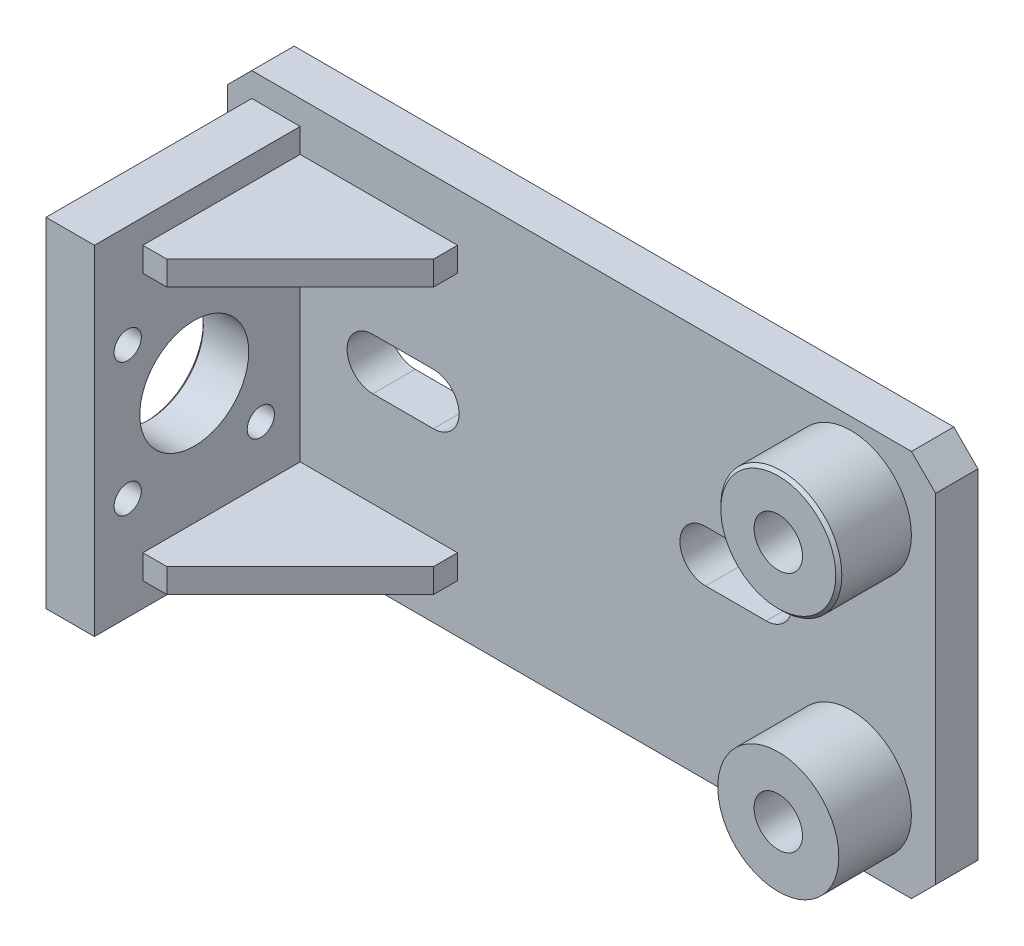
ISO-10303-21;
HEADER;
FILE_DESCRIPTION(('STEP AP214'),'2;1');
FILE_NAME('part.step','',(''),(''),'','','');
FILE_SCHEMA(('AUTOMOTIVE_DESIGN { 1 0 10303 214 1 1 1 1 }'));
ENDSEC;
DATA;
#1=APPLICATION_CONTEXT('core data for automotive mechanical design processes');
#2=APPLICATION_PROTOCOL_DEFINITION('international standard','automotive_design',2000,#1);
#3=PRODUCT_CONTEXT('',#1,'mechanical');
#4=PRODUCT('Part','Part','',(#3));
#5=PRODUCT_RELATED_PRODUCT_CATEGORY('part','',(#4));
#6=PRODUCT_DEFINITION_FORMATION('','',#4);
#7=PRODUCT_DEFINITION_CONTEXT('part definition',#1,'design');
#8=PRODUCT_DEFINITION('design','',#6,#7);
#9=PRODUCT_DEFINITION_SHAPE('','',#8);
#10=(LENGTH_UNIT() NAMED_UNIT(*) SI_UNIT(.MILLI.,.METRE.));
#11=(NAMED_UNIT(*) PLANE_ANGLE_UNIT() SI_UNIT($,.RADIAN.));
#12=(NAMED_UNIT(*) SI_UNIT($,.STERADIAN.) SOLID_ANGLE_UNIT());
#13=UNCERTAINTY_MEASURE_WITH_UNIT(LENGTH_MEASURE(1.E-05),#10,'distance_accuracy_value','');
#14=(GEOMETRIC_REPRESENTATION_CONTEXT(3) GLOBAL_UNCERTAINTY_ASSIGNED_CONTEXT((#13)) GLOBAL_UNIT_ASSIGNED_CONTEXT((#10,
#11,#12)) REPRESENTATION_CONTEXT('',''));
#15=CARTESIAN_POINT('',(0.,0.,0.));
#16=DIRECTION('',(0.,0.,1.));
#17=DIRECTION('',(1.,0.,0.));
#18=AXIS2_PLACEMENT_3D('',#15,#16,#17);
#19=CARTESIAN_POINT('',(-89.,32.,7.));
#20=DIRECTION('',(0.,0.,1.));
#21=DIRECTION('',(1.,0.,0.));
#22=AXIS2_PLACEMENT_3D('',#19,#20,#21);
#23=PLANE('',#22);
#24=CARTESIAN_POINT('',(-10.,0.,7.));
#25=DIRECTION('',(0.,0.,1.));
#26=DIRECTION('',(1.,0.,0.));
#27=AXIS2_PLACEMENT_3D('',#24,#25,#26);
#28=CIRCLE('',#27,4.25);
#29=CARTESIAN_POINT('',(-10.,4.25,7.));
#30=VERTEX_POINT('',#29);
#31=CARTESIAN_POINT('',(-9.99999999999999,-4.25,7.));
#32=VERTEX_POINT('',#31);
#33=EDGE_CURVE('E51',#30,#32,#28,.T.);
#34=ORIENTED_EDGE('',*,*,#33,.F.);
#35=DIRECTION('',(-1.,0.,0.));
#36=VECTOR('',#35,1.);
#37=CARTESIAN_POINT('',(-10.,4.25,7.));
#38=LINE('',#37,#36);
#39=CARTESIAN_POINT('',(0.,4.25,7.));
#40=VERTEX_POINT('',#39);
#41=EDGE_CURVE('E251',#40,#30,#38,.T.);
#42=ORIENTED_EDGE('',*,*,#41,.F.);
#43=CARTESIAN_POINT('',(0.,0.,7.));
#44=DIRECTION('',(0.,0.,1.));
#45=DIRECTION('',(1.,0.,0.));
#46=AXIS2_PLACEMENT_3D('',#43,#44,#45);
#47=CIRCLE('',#46,4.25);
#48=CARTESIAN_POINT('',(0.,-4.25,7.));
#49=VERTEX_POINT('',#48);
#50=EDGE_CURVE('E236',#49,#40,#47,.T.);
#51=ORIENTED_EDGE('',*,*,#50,.F.);
#52=DIRECTION('',(1.,0.,0.));
#53=VECTOR('',#52,1.);
#54=CARTESIAN_POINT('',(0.,-4.25,7.));
#55=LINE('',#54,#53);
#56=EDGE_CURVE('E245',#32,#49,#55,.T.);
#57=ORIENTED_EDGE('',*,*,#56,.F.);
#58=EDGE_LOOP('',(#34,#42,#51,#57));
#59=FACE_BOUND('',#58,.T.);
#60=CARTESIAN_POINT('',(-65.,0.,7.));
#61=DIRECTION('',(0.,0.,1.));
#62=DIRECTION('',(1.,0.,0.));
#63=AXIS2_PLACEMENT_3D('',#60,#61,#62);
#64=CIRCLE('',#63,4.25);
#65=CARTESIAN_POINT('',(-65.,4.25,7.));
#66=VERTEX_POINT('',#65);
#67=CARTESIAN_POINT('',(-65.,-4.25,7.));
#68=VERTEX_POINT('',#67);
#69=EDGE_CURVE('E258',#66,#68,#64,.T.);
#70=ORIENTED_EDGE('',*,*,#69,.F.);
#71=DIRECTION('',(-1.,0.,0.));
#72=VECTOR('',#71,1.);
#73=CARTESIAN_POINT('',(-65.,4.25,7.));
#74=LINE('',#73,#72);
#75=CARTESIAN_POINT('',(-55.,4.25,7.));
#76=VERTEX_POINT('',#75);
#77=EDGE_CURVE('E268',#76,#66,#74,.T.);
#78=ORIENTED_EDGE('',*,*,#77,.F.);
#79=CARTESIAN_POINT('',(-55.,0.,7.));
#80=DIRECTION('',(0.,0.,1.));
#81=DIRECTION('',(1.,0.,0.));
#82=AXIS2_PLACEMENT_3D('',#79,#80,#81);
#83=CIRCLE('',#82,4.25);
#84=CARTESIAN_POINT('',(-55.,-4.25,7.));
#85=VERTEX_POINT('',#84);
#86=EDGE_CURVE('E265',#85,#76,#83,.T.);
#87=ORIENTED_EDGE('',*,*,#86,.F.);
#88=DIRECTION('',(1.,0.,0.));
#89=VECTOR('',#88,1.);
#90=CARTESIAN_POINT('',(-65.,-4.25,7.));
#91=LINE('',#90,#89);
#92=EDGE_CURVE('E262',#68,#85,#91,.T.);
#93=ORIENTED_EDGE('',*,*,#92,.F.);
#94=EDGE_LOOP('',(#70,#78,#87,#93));
#95=FACE_BOUND('',#94,.T.);
#96=DIRECTION('',(-1.,0.,0.));
#97=VECTOR('',#96,1.);
#98=CARTESIAN_POINT('',(-50.9999999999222,24.,7.));
#99=LINE('',#98,#97);
#100=CARTESIAN_POINT('',(-50.9999999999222,24.,7.));
#101=VERTEX_POINT('',#100);
#102=CARTESIAN_POINT('',(-76.9999999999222,24.,7.));
#103=VERTEX_POINT('',#102);
#104=EDGE_CURVE('E335',#101,#103,#99,.T.);
#105=ORIENTED_EDGE('',*,*,#104,.F.);
#106=DIRECTION('',(0.,1.,0.));
#107=VECTOR('',#106,1.);
#108=CARTESIAN_POINT('',(-50.9999999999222,20.,7.));
#109=LINE('',#108,#107);
#110=CARTESIAN_POINT('',(-50.9999999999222,20.,7.));
#111=VERTEX_POINT('',#110);
#112=EDGE_CURVE('E320',#111,#101,#109,.T.);
#113=ORIENTED_EDGE('',*,*,#112,.F.);
#114=DIRECTION('',(-1.,0.,0.));
#115=VECTOR('',#114,1.);
#116=CARTESIAN_POINT('',(-50.9999999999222,20.,7.));
#117=LINE('',#116,#115);
#118=CARTESIAN_POINT('',(-76.9999999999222,20.,7.));
#119=VERTEX_POINT('',#118);
#120=EDGE_CURVE('E328',#111,#119,#117,.T.);
#121=ORIENTED_EDGE('',*,*,#120,.T.);
#122=DIRECTION('',(0.,1.,0.));
#123=VECTOR('',#122,1.);
#124=CARTESIAN_POINT('',(-77.,-28.,7.));
#125=LINE('',#124,#123);
#126=CARTESIAN_POINT('',(-77.,-20.,7.));
#127=VERTEX_POINT('',#126);
#128=EDGE_CURVE('E373',#127,#119,#125,.T.);
#129=ORIENTED_EDGE('',*,*,#128,.F.);
#130=DIRECTION('',(-1.,0.,0.));
#131=VECTOR('',#130,1.);
#132=CARTESIAN_POINT('',(-51.,-20.,7.));
#133=LINE('',#132,#131);
#134=CARTESIAN_POINT('',(-51.,-20.,7.));
#135=VERTEX_POINT('',#134);
#136=EDGE_CURVE('E361',#135,#127,#133,.T.);
#137=ORIENTED_EDGE('',*,*,#136,.F.);
#138=DIRECTION('',(0.,1.,0.));
#139=VECTOR('',#138,1.);
#140=CARTESIAN_POINT('',(-51.,-24.,7.));
#141=LINE('',#140,#139);
#142=CARTESIAN_POINT('',(-51.,-24.,7.));
#143=VERTEX_POINT('',#142);
#144=EDGE_CURVE('E346',#143,#135,#141,.T.);
#145=ORIENTED_EDGE('',*,*,#144,.F.);
#146=DIRECTION('',(-1.,0.,0.));
#147=VECTOR('',#146,1.);
#148=CARTESIAN_POINT('',(-51.,-24.,7.));
#149=LINE('',#148,#147);
#150=CARTESIAN_POINT('',(-77.,-24.,7.));
#151=VERTEX_POINT('',#150);
#152=EDGE_CURVE('E354',#143,#151,#149,.T.);
#153=ORIENTED_EDGE('',*,*,#152,.T.);
#154=CARTESIAN_POINT('',(-77.,-28.,7.));
#155=VERTEX_POINT('',#154);
#156=EDGE_CURVE('E369',#155,#151,#125,.T.);
#157=ORIENTED_EDGE('',*,*,#156,.F.);
#158=DIRECTION('',(-1.,0.,0.));
#159=VECTOR('',#158,1.);
#160=CARTESIAN_POINT('',(-77.,-28.,7.));
#161=LINE('',#160,#159);
#162=CARTESIAN_POINT('',(-85.,-28.,7.));
#163=VERTEX_POINT('',#162);
#164=EDGE_CURVE('E366',#155,#163,#161,.T.);
#165=ORIENTED_EDGE('',*,*,#164,.T.);
#166=DIRECTION('',(0.,-1.,0.));
#167=VECTOR('',#166,1.);
#168=CARTESIAN_POINT('',(-85.,28.,7.));
#169=LINE('',#168,#167);
#170=CARTESIAN_POINT('',(-85.,28.,7.));
#171=VERTEX_POINT('',#170);
#172=EDGE_CURVE('E363',#171,#163,#169,.T.);
#173=ORIENTED_EDGE('',*,*,#172,.F.);
#174=DIRECTION('',(1.,0.,0.));
#175=VECTOR('',#174,1.);
#176=CARTESIAN_POINT('',(-85.,28.,7.));
#177=LINE('',#176,#175);
#178=CARTESIAN_POINT('',(-77.,28.,7.));
#179=VERTEX_POINT('',#178);
#180=EDGE_CURVE('E372',#171,#179,#177,.T.);
#181=ORIENTED_EDGE('',*,*,#180,.T.);
#182=EDGE_CURVE('E368',#103,#179,#125,.T.);
#183=ORIENTED_EDGE('',*,*,#182,.F.);
#184=EDGE_LOOP('',(#105,#113,#121,#129,#137,#145,#153,#157,#165,#173,#181,#183));
#185=FACE_BOUND('',#184,.T.);
#186=CARTESIAN_POINT('',(14.,-20.,6.99999999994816));
#187=DIRECTION('',(0.,0.,1.));
#188=DIRECTION('',(1.,0.,0.));
#189=AXIS2_PLACEMENT_3D('',#186,#187,#188);
#190=CIRCLE('',#189,10.);
#191=CARTESIAN_POINT('',(24.,-20.,6.99999999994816));
#192=VERTEX_POINT('',#191);
#193=EDGE_CURVE('E398',#192,#192,#190,.T.);
#194=ORIENTED_EDGE('',*,*,#193,.F.);
#195=EDGE_LOOP('',(#194));
#196=FACE_BOUND('',#195,.T.);
#197=DIRECTION('',(0.,1.,0.));
#198=VECTOR('',#197,1.);
#199=CARTESIAN_POINT('',(28.,-32.,7.));
#200=LINE('',#199,#198);
#201=CARTESIAN_POINT('',(28.,-28.,7.));
#202=VERTEX_POINT('',#201);
#203=CARTESIAN_POINT('',(28.,27.9999999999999,7.));
#204=VERTEX_POINT('',#203);
#205=EDGE_CURVE('E425',#202,#204,#200,.T.);
#206=ORIENTED_EDGE('',*,*,#205,.T.);
#207=DIRECTION('',(-0.707106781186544,0.707106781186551,0.));
#208=VECTOR('',#207,1.);
#209=CARTESIAN_POINT('',(-32.4999999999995,88.5,7.));
#210=LINE('',#209,#208);
#211=CARTESIAN_POINT('',(24.,32.,7.));
#212=VERTEX_POINT('',#211);
#213=EDGE_CURVE('E455',#204,#212,#210,.T.);
#214=ORIENTED_EDGE('',*,*,#213,.T.);
#215=DIRECTION('',(1.,0.,0.));
#216=VECTOR('',#215,1.);
#217=CARTESIAN_POINT('',(-89.,32.,7.));
#218=LINE('',#217,#216);
#219=CARTESIAN_POINT('',(-85.,32.,7.));
#220=VERTEX_POINT('',#219);
#221=EDGE_CURVE('E428',#220,#212,#218,.T.);
#222=ORIENTED_EDGE('',*,*,#221,.F.);
#223=DIRECTION('',(-0.707106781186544,-0.707106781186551,0.));
#224=VECTOR('',#223,1.);
#225=CARTESIAN_POINT('',(-87.,30.,7.));
#226=LINE('',#225,#224);
#227=CARTESIAN_POINT('',(-89.,27.9999999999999,7.));
#228=VERTEX_POINT('',#227);
#229=EDGE_CURVE('E453',#220,#228,#226,.T.);
#230=ORIENTED_EDGE('',*,*,#229,.T.);
#231=DIRECTION('',(0.,-1.,0.));
#232=VECTOR('',#231,1.);
#233=CARTESIAN_POINT('',(-89.,32.,7.));
#234=LINE('',#233,#232);
#235=CARTESIAN_POINT('',(-89.,-27.9999999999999,7.));
#236=VERTEX_POINT('',#235);
#237=EDGE_CURVE('E419',#228,#236,#234,.T.);
#238=ORIENTED_EDGE('',*,*,#237,.T.);
#239=DIRECTION('',(0.707106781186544,-0.707106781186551,0.));
#240=VECTOR('',#239,1.);
#241=CARTESIAN_POINT('',(-119.,2.00000000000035,7.));
#242=LINE('',#241,#240);
#243=CARTESIAN_POINT('',(-85.,-32.,7.));
#244=VERTEX_POINT('',#243);
#245=EDGE_CURVE('E451',#236,#244,#242,.T.);
#246=ORIENTED_EDGE('',*,*,#245,.T.);
#247=DIRECTION('',(-1.,0.,0.));
#248=VECTOR('',#247,1.);
#249=CARTESIAN_POINT('',(28.,-32.,7.));
#250=LINE('',#249,#248);
#251=CARTESIAN_POINT('',(24.,-32.,7.));
#252=VERTEX_POINT('',#251);
#253=EDGE_CURVE('E422',#252,#244,#250,.T.);
#254=ORIENTED_EDGE('',*,*,#253,.F.);
#255=DIRECTION('',(0.707106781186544,0.707106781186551,0.));
#256=VECTOR('',#255,1.);
#257=CARTESIAN_POINT('',(-0.499999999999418,-56.4999999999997,7.));
#258=LINE('',#257,#256);
#259=EDGE_CURVE('E449',#252,#202,#258,.T.);
#260=ORIENTED_EDGE('',*,*,#259,.T.);
#261=EDGE_LOOP('',(#206,#214,#222,#230,#238,#246,#254,#260));
#262=FACE_BOUND('',#261,.T.);
#263=CARTESIAN_POINT('',(14.,20.,7.));
#264=DIRECTION('',(0.,0.,1.));
#265=DIRECTION('',(1.,0.,0.));
#266=AXIS2_PLACEMENT_3D('',#263,#264,#265);
#267=CIRCLE('',#266,10.);
#268=CARTESIAN_POINT('',(24.,20.,7.));
#269=VERTEX_POINT('',#268);
#270=EDGE_CURVE('E404',#269,#269,#267,.T.);
#271=ORIENTED_EDGE('',*,*,#270,.F.);
#272=EDGE_LOOP('',(#271));
#273=FACE_BOUND('',#272,.T.);
#274=ADVANCED_FACE('F36',(#59,#95,#185,#196,#262,#273),#23,.T.);
#275=CARTESIAN_POINT('',(-89.,32.,7.));
#276=DIRECTION('',(1.,0.,0.));
#277=DIRECTION('',(0.,0.,-1.));
#278=AXIS2_PLACEMENT_3D('',#275,#276,#277);
#279=PLANE('',#278);
#280=ORIENTED_EDGE('',*,*,#237,.F.);
#281=DIRECTION('',(0.,0.,-1.));
#282=VECTOR('',#281,1.);
#283=CARTESIAN_POINT('',(-89.,27.9999999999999,0.));
#284=LINE('',#283,#282);
#285=CARTESIAN_POINT('',(-89.,27.9999999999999,0.));
#286=VERTEX_POINT('',#285);
#287=EDGE_CURVE('E459',#228,#286,#284,.T.);
#288=ORIENTED_EDGE('',*,*,#287,.T.);
#289=DIRECTION('',(0.,-1.,0.));
#290=VECTOR('',#289,1.);
#291=CARTESIAN_POINT('',(-89.,32.,0.));
#292=LINE('',#291,#290);
#293=CARTESIAN_POINT('',(-89.,-27.9999999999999,0.));
#294=VERTEX_POINT('',#293);
#295=EDGE_CURVE('E407',#286,#294,#292,.T.);
#296=ORIENTED_EDGE('',*,*,#295,.T.);
#297=DIRECTION('',(0.,0.,1.));
#298=VECTOR('',#297,1.);
#299=CARTESIAN_POINT('',(-89.,-27.9999999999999,7.));
#300=LINE('',#299,#298);
#301=EDGE_CURVE('E457',#294,#236,#300,.T.);
#302=ORIENTED_EDGE('',*,*,#301,.T.);
#303=EDGE_LOOP('',(#280,#288,#296,#302));
#304=FACE_BOUND('',#303,.T.);
#305=ADVANCED_FACE('F38',(#304),#279,.F.);
#306=CARTESIAN_POINT('',(28.,-32.,7.));
#307=DIRECTION('',(0.,-1.,0.));
#308=DIRECTION('',(1.,0.,0.));
#309=AXIS2_PLACEMENT_3D('',#306,#307,#308);
#310=PLANE('',#309);
#311=ORIENTED_EDGE('',*,*,#253,.T.);
#312=DIRECTION('',(0.,0.,-1.));
#313=VECTOR('',#312,1.);
#314=CARTESIAN_POINT('',(-85.,-32.,0.));
#315=LINE('',#314,#313);
#316=CARTESIAN_POINT('',(-85.,-32.,0.));
#317=VERTEX_POINT('',#316);
#318=EDGE_CURVE('E464',#244,#317,#315,.T.);
#319=ORIENTED_EDGE('',*,*,#318,.T.);
#320=DIRECTION('',(-1.,0.,0.));
#321=VECTOR('',#320,1.);
#322=CARTESIAN_POINT('',(28.,-32.,0.));
#323=LINE('',#322,#321);
#324=CARTESIAN_POINT('',(24.,-32.,0.));
#325=VERTEX_POINT('',#324);
#326=EDGE_CURVE('E410',#325,#317,#323,.T.);
#327=ORIENTED_EDGE('',*,*,#326,.F.);
#328=DIRECTION('',(0.,0.,1.));
#329=VECTOR('',#328,1.);
#330=CARTESIAN_POINT('',(24.,-32.,7.));
#331=LINE('',#330,#329);
#332=EDGE_CURVE('E462',#325,#252,#331,.T.);
#333=ORIENTED_EDGE('',*,*,#332,.T.);
#334=EDGE_LOOP('',(#311,#319,#327,#333));
#335=FACE_BOUND('',#334,.T.);
#336=ADVANCED_FACE('F545',(#335),#310,.T.);
#337=CARTESIAN_POINT('',(28.,-32.,7.));
#338=DIRECTION('',(-1.,0.,0.));
#339=DIRECTION('',(0.,0.,1.));
#340=AXIS2_PLACEMENT_3D('',#337,#338,#339);
#341=PLANE('',#340);
#342=DIRECTION('',(0.,1.,0.));
#343=VECTOR('',#342,1.);
#344=CARTESIAN_POINT('',(28.,-32.,0.));
#345=LINE('',#344,#343);
#346=CARTESIAN_POINT('',(28.,-27.9999999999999,0.));
#347=VERTEX_POINT('',#346);
#348=CARTESIAN_POINT('',(28.,27.9999999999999,0.));
#349=VERTEX_POINT('',#348);
#350=EDGE_CURVE('E413',#347,#349,#345,.T.);
#351=ORIENTED_EDGE('',*,*,#350,.T.);
#352=DIRECTION('',(0.,0.,1.));
#353=VECTOR('',#352,1.);
#354=CARTESIAN_POINT('',(28.,27.9999999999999,7.));
#355=LINE('',#354,#353);
#356=EDGE_CURVE('E447',#349,#204,#355,.T.);
#357=ORIENTED_EDGE('',*,*,#356,.T.);
#358=ORIENTED_EDGE('',*,*,#205,.F.);
#359=DIRECTION('',(0.,0.,-1.));
#360=VECTOR('',#359,1.);
#361=CARTESIAN_POINT('',(28.,-27.9999999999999,0.));
#362=LINE('',#361,#360);
#363=EDGE_CURVE('E444',#202,#347,#362,.T.);
#364=ORIENTED_EDGE('',*,*,#363,.T.);
#365=EDGE_LOOP('',(#351,#357,#358,#364));
#366=FACE_BOUND('',#365,.T.);
#367=ADVANCED_FACE('F553',(#366),#341,.F.);
#368=CARTESIAN_POINT('',(-89.,32.,7.));
#369=DIRECTION('',(0.,1.,0.));
#370=DIRECTION('',(0.,0.,1.));
#371=AXIS2_PLACEMENT_3D('',#368,#369,#370);
#372=PLANE('',#371);
#373=ORIENTED_EDGE('',*,*,#221,.T.);
#374=DIRECTION('',(0.,0.,-1.));
#375=VECTOR('',#374,1.);
#376=CARTESIAN_POINT('',(24.,32.,0.));
#377=LINE('',#376,#375);
#378=CARTESIAN_POINT('',(24.,32.,0.));
#379=VERTEX_POINT('',#378);
#380=EDGE_CURVE('E433',#212,#379,#377,.T.);
#381=ORIENTED_EDGE('',*,*,#380,.T.);
#382=DIRECTION('',(1.,0.,0.));
#383=VECTOR('',#382,1.);
#384=CARTESIAN_POINT('',(-89.,32.,0.));
#385=LINE('',#384,#383);
#386=CARTESIAN_POINT('',(-85.,32.,0.));
#387=VERTEX_POINT('',#386);
#388=EDGE_CURVE('E416',#387,#379,#385,.T.);
#389=ORIENTED_EDGE('',*,*,#388,.F.);
#390=DIRECTION('',(0.,0.,1.));
#391=VECTOR('',#390,1.);
#392=CARTESIAN_POINT('',(-85.,32.,7.));
#393=LINE('',#392,#391);
#394=EDGE_CURVE('E431',#387,#220,#393,.T.);
#395=ORIENTED_EDGE('',*,*,#394,.T.);
#396=EDGE_LOOP('',(#373,#381,#389,#395));
#397=FACE_BOUND('',#396,.T.);
#398=ADVANCED_FACE('F550',(#397),#372,.T.);
#399=CARTESIAN_POINT('',(-89.,32.,0.));
#400=DIRECTION('',(0.,0.,1.));
#401=DIRECTION('',(1.,0.,0.));
#402=AXIS2_PLACEMENT_3D('',#399,#400,#401);
#403=PLANE('',#402);
#404=DIRECTION('',(-1.,0.,0.));
#405=VECTOR('',#404,1.);
#406=CARTESIAN_POINT('',(-89.,4.25,0.));
#407=LINE('',#406,#405);
#408=CARTESIAN_POINT('',(0.,4.25,0.));
#409=VERTEX_POINT('',#408);
#410=CARTESIAN_POINT('',(-10.,4.25,0.));
#411=VERTEX_POINT('',#410);
#412=EDGE_CURVE('E44',#409,#411,#407,.T.);
#413=ORIENTED_EDGE('',*,*,#412,.T.);
#414=CARTESIAN_POINT('',(-10.,0.,0.));
#415=DIRECTION('',(0.,0.,1.));
#416=DIRECTION('',(1.,0.,0.));
#417=AXIS2_PLACEMENT_3D('',#414,#415,#416);
#418=CIRCLE('',#417,4.25);
#419=CARTESIAN_POINT('',(-10.,-4.25,0.));
#420=VERTEX_POINT('',#419);
#421=EDGE_CURVE('E11',#411,#420,#418,.T.);
#422=ORIENTED_EDGE('',*,*,#421,.T.);
#423=DIRECTION('',(1.,0.,0.));
#424=VECTOR('',#423,1.);
#425=CARTESIAN_POINT('',(-89.,-4.25,0.));
#426=LINE('',#425,#424);
#427=CARTESIAN_POINT('',(0.,-4.25,0.));
#428=VERTEX_POINT('',#427);
#429=EDGE_CURVE('E517',#420,#428,#426,.T.);
#430=ORIENTED_EDGE('',*,*,#429,.T.);
#431=CARTESIAN_POINT('',(0.,0.,0.));
#432=DIRECTION('',(0.,0.,1.));
#433=DIRECTION('',(1.,0.,0.));
#434=AXIS2_PLACEMENT_3D('',#431,#432,#433);
#435=CIRCLE('',#434,4.25);
#436=EDGE_CURVE('E239',#428,#409,#435,.T.);
#437=ORIENTED_EDGE('',*,*,#436,.T.);
#438=EDGE_LOOP('',(#413,#422,#430,#437));
#439=FACE_BOUND('',#438,.T.);
#440=DIRECTION('',(-1.,0.,0.));
#441=VECTOR('',#440,1.);
#442=CARTESIAN_POINT('',(-89.,4.25,0.));
#443=LINE('',#442,#441);
#444=CARTESIAN_POINT('',(-55.,4.25,0.));
#445=VERTEX_POINT('',#444);
#446=CARTESIAN_POINT('',(-65.,4.25,0.));
#447=VERTEX_POINT('',#446);
#448=EDGE_CURVE('E511',#445,#447,#443,.T.);
#449=ORIENTED_EDGE('',*,*,#448,.T.);
#450=CARTESIAN_POINT('',(-65.,0.,0.));
#451=DIRECTION('',(0.,0.,1.));
#452=DIRECTION('',(1.,0.,0.));
#453=AXIS2_PLACEMENT_3D('',#450,#451,#452);
#454=CIRCLE('',#453,4.25);
#455=CARTESIAN_POINT('',(-65.,-4.25,0.));
#456=VERTEX_POINT('',#455);
#457=EDGE_CURVE('E514',#447,#456,#454,.T.);
#458=ORIENTED_EDGE('',*,*,#457,.T.);
#459=DIRECTION('',(1.,0.,0.));
#460=VECTOR('',#459,1.);
#461=CARTESIAN_POINT('',(-89.,-4.25,0.));
#462=LINE('',#461,#460);
#463=CARTESIAN_POINT('',(-55.,-4.25,0.));
#464=VERTEX_POINT('',#463);
#465=EDGE_CURVE('E497',#456,#464,#462,.T.);
#466=ORIENTED_EDGE('',*,*,#465,.T.);
#467=CARTESIAN_POINT('',(-55.,0.,0.));
#468=DIRECTION('',(0.,0.,1.));
#469=DIRECTION('',(1.,0.,0.));
#470=AXIS2_PLACEMENT_3D('',#467,#468,#469);
#471=CIRCLE('',#470,4.25);
#472=EDGE_CURVE('E508',#464,#445,#471,.T.);
#473=ORIENTED_EDGE('',*,*,#472,.T.);
#474=EDGE_LOOP('',(#449,#458,#466,#473));
#475=FACE_BOUND('',#474,.T.);
#476=CARTESIAN_POINT('',(14.,-20.,0.));
#477=DIRECTION('',(0.,0.,1.));
#478=DIRECTION('',(1.,0.,0.));
#479=AXIS2_PLACEMENT_3D('',#476,#477,#478);
#480=CIRCLE('',#479,4.);
#481=CARTESIAN_POINT('',(18.,-20.,0.));
#482=VERTEX_POINT('',#481);
#483=EDGE_CURVE('E299',#482,#482,#480,.T.);
#484=ORIENTED_EDGE('',*,*,#483,.T.);
#485=EDGE_LOOP('',(#484));
#486=FACE_BOUND('',#485,.T.);
#487=CARTESIAN_POINT('',(14.,20.,0.));
#488=DIRECTION('',(0.,0.,1.));
#489=DIRECTION('',(1.,0.,0.));
#490=AXIS2_PLACEMENT_3D('',#487,#488,#489);
#491=CIRCLE('',#490,4.);
#492=CARTESIAN_POINT('',(18.,20.,0.));
#493=VERTEX_POINT('',#492);
#494=EDGE_CURVE('E305',#493,#493,#491,.T.);
#495=ORIENTED_EDGE('',*,*,#494,.T.);
#496=EDGE_LOOP('',(#495));
#497=FACE_BOUND('',#496,.T.);
#498=ORIENTED_EDGE('',*,*,#388,.T.);
#499=DIRECTION('',(0.707106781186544,-0.707106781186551,0.));
#500=VECTOR('',#499,1.);
#501=CARTESIAN_POINT('',(24.,32.,0.));
#502=LINE('',#501,#500);
#503=EDGE_CURVE('E442',#379,#349,#502,.T.);
#504=ORIENTED_EDGE('',*,*,#503,.T.);
#505=ORIENTED_EDGE('',*,*,#350,.F.);
#506=DIRECTION('',(-0.707106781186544,-0.707106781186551,0.));
#507=VECTOR('',#506,1.);
#508=CARTESIAN_POINT('',(28.,-27.9999999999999,0.));
#509=LINE('',#508,#507);
#510=EDGE_CURVE('E436',#347,#325,#509,.T.);
#511=ORIENTED_EDGE('',*,*,#510,.T.);
#512=ORIENTED_EDGE('',*,*,#326,.T.);
#513=DIRECTION('',(-0.707106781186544,0.707106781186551,0.));
#514=VECTOR('',#513,1.);
#515=CARTESIAN_POINT('',(-85.,-32.,0.));
#516=LINE('',#515,#514);
#517=EDGE_CURVE('E438',#317,#294,#516,.T.);
#518=ORIENTED_EDGE('',*,*,#517,.T.);
#519=ORIENTED_EDGE('',*,*,#295,.F.);
#520=DIRECTION('',(0.707106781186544,0.707106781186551,0.));
#521=VECTOR('',#520,1.);
#522=CARTESIAN_POINT('',(-89.,27.9999999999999,0.));
#523=LINE('',#522,#521);
#524=EDGE_CURVE('E440',#286,#387,#523,.T.);
#525=ORIENTED_EDGE('',*,*,#524,.T.);
#526=EDGE_LOOP('',(#498,#504,#505,#511,#512,#518,#519,#525));
#527=FACE_BOUND('',#526,.T.);
#528=ADVANCED_FACE('F521',(#439,#475,#486,#497,#527),#403,.F.);
#529=CARTESIAN_POINT('',(24.,32.,7.));
#530=DIRECTION('',(0.707106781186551,0.707106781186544,0.));
#531=DIRECTION('',(-0.707106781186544,0.707106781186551,0.));
#532=AXIS2_PLACEMENT_3D('',#529,#530,#531);
#533=PLANE('',#532);
#534=ORIENTED_EDGE('',*,*,#213,.F.);
#535=ORIENTED_EDGE('',*,*,#356,.F.);
#536=ORIENTED_EDGE('',*,*,#503,.F.);
#537=ORIENTED_EDGE('',*,*,#380,.F.);
#538=EDGE_LOOP('',(#534,#535,#536,#537));
#539=FACE_BOUND('',#538,.T.);
#540=ADVANCED_FACE('F584',(#539),#533,.T.);
#541=CARTESIAN_POINT('',(-89.,27.9999999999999,7.));
#542=DIRECTION('',(-0.707106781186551,0.707106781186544,0.));
#543=DIRECTION('',(-0.707106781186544,-0.707106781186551,0.));
#544=AXIS2_PLACEMENT_3D('',#541,#542,#543);
#545=PLANE('',#544);
#546=ORIENTED_EDGE('',*,*,#229,.F.);
#547=ORIENTED_EDGE('',*,*,#394,.F.);
#548=ORIENTED_EDGE('',*,*,#524,.F.);
#549=ORIENTED_EDGE('',*,*,#287,.F.);
#550=EDGE_LOOP('',(#546,#547,#548,#549));
#551=FACE_BOUND('',#550,.T.);
#552=ADVANCED_FACE('F577',(#551),#545,.T.);
#553=CARTESIAN_POINT('',(-85.,-32.,7.));
#554=DIRECTION('',(-0.707106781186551,-0.707106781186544,0.));
#555=DIRECTION('',(0.707106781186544,-0.707106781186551,0.));
#556=AXIS2_PLACEMENT_3D('',#553,#554,#555);
#557=PLANE('',#556);
#558=ORIENTED_EDGE('',*,*,#245,.F.);
#559=ORIENTED_EDGE('',*,*,#301,.F.);
#560=ORIENTED_EDGE('',*,*,#517,.F.);
#561=ORIENTED_EDGE('',*,*,#318,.F.);
#562=EDGE_LOOP('',(#558,#559,#560,#561));
#563=FACE_BOUND('',#562,.T.);
#564=ADVANCED_FACE('F569',(#563),#557,.T.);
#565=CARTESIAN_POINT('',(28.,-27.9999999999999,7.));
#566=DIRECTION('',(0.707106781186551,-0.707106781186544,0.));
#567=DIRECTION('',(0.707106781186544,0.707106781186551,0.));
#568=AXIS2_PLACEMENT_3D('',#565,#566,#567);
#569=PLANE('',#568);
#570=ORIENTED_EDGE('',*,*,#259,.F.);
#571=ORIENTED_EDGE('',*,*,#332,.F.);
#572=ORIENTED_EDGE('',*,*,#510,.F.);
#573=ORIENTED_EDGE('',*,*,#363,.F.);
#574=EDGE_LOOP('',(#570,#571,#572,#573));
#575=FACE_BOUND('',#574,.T.);
#576=ADVANCED_FACE('F590',(#575),#569,.T.);
#577=CARTESIAN_POINT('',(14.,20.,19.));
#578=DIRECTION('',(0.,0.,-1.));
#579=DIRECTION('',(-1.,0.,0.));
#580=AXIS2_PLACEMENT_3D('',#577,#578,#579);
#581=CYLINDRICAL_SURFACE('',#580,10.);
#582=CARTESIAN_POINT('',(14.,20.,18.5));
#583=DIRECTION('',(0.,0.,1.));
#584=DIRECTION('',(1.,0.,0.));
#585=AXIS2_PLACEMENT_3D('',#582,#583,#584);
#586=CIRCLE('',#585,10.);
#587=CARTESIAN_POINT('',(24.,20.,18.5));
#588=VERTEX_POINT('',#587);
#589=EDGE_CURVE('E470',#588,#588,#586,.F.);
#590=ORIENTED_EDGE('',*,*,#589,.T.);
#591=EDGE_LOOP('',(#590));
#592=FACE_BOUND('',#591,.T.);
#593=ORIENTED_EDGE('',*,*,#270,.T.);
#594=EDGE_LOOP('',(#593));
#595=FACE_BOUND('',#594,.T.);
#596=ADVANCED_FACE('F594',(#592,#595),#581,.T.);
#597=CARTESIAN_POINT('',(14.,20.,19.));
#598=DIRECTION('',(0.,0.,1.));
#599=DIRECTION('',(1.,0.,0.));
#600=AXIS2_PLACEMENT_3D('',#597,#598,#599);
#601=PLANE('',#600);
#602=CARTESIAN_POINT('',(14.,20.,19.));
#603=DIRECTION('',(0.,0.,1.));
#604=DIRECTION('',(1.,0.,0.));
#605=AXIS2_PLACEMENT_3D('',#602,#603,#604);
#606=CIRCLE('',#605,4.);
#607=CARTESIAN_POINT('',(18.,20.,19.));
#608=VERTEX_POINT('',#607);
#609=EDGE_CURVE('E302',#608,#608,#606,.T.);
#610=ORIENTED_EDGE('',*,*,#609,.F.);
#611=EDGE_LOOP('',(#610));
#612=FACE_BOUND('',#611,.T.);
#613=CARTESIAN_POINT('',(14.,20.,19.));
#614=DIRECTION('',(0.,0.,1.));
#615=DIRECTION('',(1.,0.,0.));
#616=AXIS2_PLACEMENT_3D('',#613,#614,#615);
#617=CIRCLE('',#616,9.49999999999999);
#618=CARTESIAN_POINT('',(23.5,20.,19.));
#619=VERTEX_POINT('',#618);
#620=EDGE_CURVE('E467',#619,#619,#617,.T.);
#621=ORIENTED_EDGE('',*,*,#620,.T.);
#622=EDGE_LOOP('',(#621));
#623=FACE_BOUND('',#622,.T.);
#624=ADVANCED_FACE('F596',(#612,#623),#601,.T.);
#625=CARTESIAN_POINT('',(14.,20.,19.));
#626=DIRECTION('',(0.,0.,-1.));
#627=DIRECTION('',(-1.,0.,0.));
#628=AXIS2_PLACEMENT_3D('',#625,#626,#627);
#629=CONICAL_SURFACE('',#628,9.49999999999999,0.785398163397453);
#630=ORIENTED_EDGE('',*,*,#589,.F.);
#631=EDGE_LOOP('',(#630));
#632=FACE_BOUND('',#631,.T.);
#633=ORIENTED_EDGE('',*,*,#620,.F.);
#634=EDGE_LOOP('',(#633));
#635=FACE_BOUND('',#634,.T.);
#636=ADVANCED_FACE('F603',(#632,#635),#629,.T.);
#637=CARTESIAN_POINT('',(14.,-20.,18.9999999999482));
#638=DIRECTION('',(0.,0.,-1.));
#639=DIRECTION('',(-1.,0.,0.));
#640=AXIS2_PLACEMENT_3D('',#637,#638,#639);
#641=CYLINDRICAL_SURFACE('',#640,10.);
#642=CARTESIAN_POINT('',(14.,-20.,18.9999999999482));
#643=DIRECTION('',(0.,0.,1.));
#644=DIRECTION('',(1.,0.,0.));
#645=AXIS2_PLACEMENT_3D('',#642,#643,#644);
#646=CIRCLE('',#645,10.);
#647=CARTESIAN_POINT('',(24.,-20.,18.9999999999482));
#648=VERTEX_POINT('',#647);
#649=EDGE_CURVE('E401',#648,#648,#646,.T.);
#650=ORIENTED_EDGE('',*,*,#649,.F.);
#651=EDGE_LOOP('',(#650));
#652=FACE_BOUND('',#651,.T.);
#653=ORIENTED_EDGE('',*,*,#193,.T.);
#654=EDGE_LOOP('',(#653));
#655=FACE_BOUND('',#654,.T.);
#656=ADVANCED_FACE('F681',(#652,#655),#641,.T.);
#657=CARTESIAN_POINT('',(14.,-20.,18.9999999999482));
#658=DIRECTION('',(0.,0.,1.));
#659=DIRECTION('',(1.,0.,0.));
#660=AXIS2_PLACEMENT_3D('',#657,#658,#659);
#661=PLANE('',#660);
#662=CARTESIAN_POINT('',(14.,-20.,18.9999999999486));
#663=DIRECTION('',(0.,0.,1.));
#664=DIRECTION('',(1.,0.,0.));
#665=AXIS2_PLACEMENT_3D('',#662,#663,#664);
#666=CIRCLE('',#665,4.);
#667=CARTESIAN_POINT('',(18.,-20.,18.9999999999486));
#668=VERTEX_POINT('',#667);
#669=EDGE_CURVE('E296',#668,#668,#666,.T.);
#670=ORIENTED_EDGE('',*,*,#669,.F.);
#671=EDGE_LOOP('',(#670));
#672=FACE_BOUND('',#671,.T.);
#673=ORIENTED_EDGE('',*,*,#649,.T.);
#674=EDGE_LOOP('',(#673));
#675=FACE_BOUND('',#674,.T.);
#676=ADVANCED_FACE('F689',(#672,#675),#661,.T.);
#677=CARTESIAN_POINT('',(-85.,28.,41.));
#678=DIRECTION('',(1.,0.,0.));
#679=DIRECTION('',(0.,0.,-1.));
#680=AXIS2_PLACEMENT_3D('',#677,#678,#679);
#681=PLANE('',#680);
#682=CARTESIAN_POINT('',(-85.,-11.,35.5));
#683=DIRECTION('',(-1.,0.,0.));
#684=DIRECTION('',(0.,0.,1.));
#685=AXIS2_PLACEMENT_3D('',#682,#683,#684);
#686=CIRCLE('',#685,2.25);
#687=CARTESIAN_POINT('',(-85.,-11.,37.75));
#688=VERTEX_POINT('',#687);
#689=EDGE_CURVE('E274',#688,#688,#686,.T.);
#690=ORIENTED_EDGE('',*,*,#689,.F.);
#691=EDGE_LOOP('',(#690));
#692=FACE_BOUND('',#691,.T.);
#693=CARTESIAN_POINT('',(-85.,-11.,13.5));
#694=DIRECTION('',(-1.,0.,0.));
#695=DIRECTION('',(0.,0.,1.));
#696=AXIS2_PLACEMENT_3D('',#693,#694,#695);
#697=CIRCLE('',#696,2.25);
#698=CARTESIAN_POINT('',(-85.,-11.,15.75));
#699=VERTEX_POINT('',#698);
#700=EDGE_CURVE('E284',#699,#699,#697,.T.);
#701=ORIENTED_EDGE('',*,*,#700,.F.);
#702=EDGE_LOOP('',(#701));
#703=FACE_BOUND('',#702,.T.);
#704=CARTESIAN_POINT('',(-85.,11.,13.5));
#705=DIRECTION('',(-1.,0.,0.));
#706=DIRECTION('',(0.,0.,1.));
#707=AXIS2_PLACEMENT_3D('',#704,#705,#706);
#708=CIRCLE('',#707,2.25);
#709=CARTESIAN_POINT('',(-85.,11.,15.75));
#710=VERTEX_POINT('',#709);
#711=EDGE_CURVE('E288',#710,#710,#708,.T.);
#712=ORIENTED_EDGE('',*,*,#711,.F.);
#713=EDGE_LOOP('',(#712));
#714=FACE_BOUND('',#713,.T.);
#715=CARTESIAN_POINT('',(-85.,11.,35.5));
#716=DIRECTION('',(-1.,0.,0.));
#717=DIRECTION('',(0.,0.,1.));
#718=AXIS2_PLACEMENT_3D('',#715,#716,#717);
#719=CIRCLE('',#718,2.25);
#720=CARTESIAN_POINT('',(-85.,11.,37.75));
#721=VERTEX_POINT('',#720);
#722=EDGE_CURVE('E292',#721,#721,#719,.T.);
#723=ORIENTED_EDGE('',*,*,#722,.F.);
#724=EDGE_LOOP('',(#723));
#725=FACE_BOUND('',#724,.T.);
#726=CARTESIAN_POINT('',(-85.,0.,24.5));
#727=DIRECTION('',(1.,0.,0.));
#728=DIRECTION('',(0.,0.,-1.));
#729=AXIS2_PLACEMENT_3D('',#726,#727,#728);
#730=CIRCLE('',#729,9.50000000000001);
#731=CARTESIAN_POINT('',(-85.,0.,15.));
#732=VERTEX_POINT('',#731);
#733=EDGE_CURVE('E491',#732,#732,#730,.T.);
#734=ORIENTED_EDGE('',*,*,#733,.T.);
#735=EDGE_LOOP('',(#734));
#736=FACE_BOUND('',#735,.T.);
#737=ORIENTED_EDGE('',*,*,#172,.T.);
#738=DIRECTION('',(0.,0.,-1.));
#739=VECTOR('',#738,1.);
#740=CARTESIAN_POINT('',(-85.,-28.,41.));
#741=LINE('',#740,#739);
#742=CARTESIAN_POINT('',(-85.,-28.,41.));
#743=VERTEX_POINT('',#742);
#744=EDGE_CURVE('E395',#743,#163,#741,.T.);
#745=ORIENTED_EDGE('',*,*,#744,.F.);
#746=DIRECTION('',(0.,-1.,0.));
#747=VECTOR('',#746,1.);
#748=CARTESIAN_POINT('',(-85.,28.,41.));
#749=LINE('',#748,#747);
#750=CARTESIAN_POINT('',(-85.,28.,41.));
#751=VERTEX_POINT('',#750);
#752=EDGE_CURVE('E376',#751,#743,#749,.T.);
#753=ORIENTED_EDGE('',*,*,#752,.F.);
#754=DIRECTION('',(0.,0.,-1.));
#755=VECTOR('',#754,1.);
#756=CARTESIAN_POINT('',(-85.,28.,41.));
#757=LINE('',#756,#755);
#758=EDGE_CURVE('E386',#751,#171,#757,.T.);
#759=ORIENTED_EDGE('',*,*,#758,.T.);
#760=EDGE_LOOP('',(#737,#745,#753,#759));
#761=FACE_BOUND('',#760,.T.);
#762=ADVANCED_FACE('F699',(#692,#703,#714,#725,#736,#761),#681,.F.);
#763=CARTESIAN_POINT('',(-77.,-28.,41.));
#764=DIRECTION('',(0.,-1.,0.));
#765=DIRECTION('',(0.,0.,-1.));
#766=AXIS2_PLACEMENT_3D('',#763,#764,#765);
#767=PLANE('',#766);
#768=ORIENTED_EDGE('',*,*,#164,.F.);
#769=DIRECTION('',(0.,0.,-1.));
#770=VECTOR('',#769,1.);
#771=CARTESIAN_POINT('',(-77.,-28.,41.));
#772=LINE('',#771,#770);
#773=CARTESIAN_POINT('',(-77.,-28.,41.));
#774=VERTEX_POINT('',#773);
#775=EDGE_CURVE('E392',#774,#155,#772,.T.);
#776=ORIENTED_EDGE('',*,*,#775,.F.);
#777=DIRECTION('',(-1.,0.,0.));
#778=VECTOR('',#777,1.);
#779=CARTESIAN_POINT('',(-77.,-28.,41.));
#780=LINE('',#779,#778);
#781=EDGE_CURVE('E378',#774,#743,#780,.T.);
#782=ORIENTED_EDGE('',*,*,#781,.T.);
#783=ORIENTED_EDGE('',*,*,#744,.T.);
#784=EDGE_LOOP('',(#768,#776,#782,#783));
#785=FACE_BOUND('',#784,.T.);
#786=ADVANCED_FACE('F714',(#785),#767,.T.);
#787=CARTESIAN_POINT('',(-77.,-28.,41.));
#788=DIRECTION('',(-1.,0.,0.));
#789=DIRECTION('',(0.,0.,1.));
#790=AXIS2_PLACEMENT_3D('',#787,#788,#789);
#791=PLANE('',#790);
#792=CARTESIAN_POINT('',(-77.,-11.,35.5));
#793=DIRECTION('',(-1.,0.,0.));
#794=DIRECTION('',(0.,0.,1.));
#795=AXIS2_PLACEMENT_3D('',#792,#793,#794);
#796=CIRCLE('',#795,2.25);
#797=CARTESIAN_POINT('',(-77.,-11.,37.75));
#798=VERTEX_POINT('',#797);
#799=EDGE_CURVE('E283',#798,#798,#796,.T.);
#800=ORIENTED_EDGE('',*,*,#799,.T.);
#801=EDGE_LOOP('',(#800));
#802=FACE_BOUND('',#801,.T.);
#803=CARTESIAN_POINT('',(-77.,-11.,13.5));
#804=DIRECTION('',(-1.,0.,0.));
#805=DIRECTION('',(0.,0.,1.));
#806=AXIS2_PLACEMENT_3D('',#803,#804,#805);
#807=CIRCLE('',#806,2.25);
#808=CARTESIAN_POINT('',(-77.,-11.,15.75));
#809=VERTEX_POINT('',#808);
#810=EDGE_CURVE('E287',#809,#809,#807,.T.);
#811=ORIENTED_EDGE('',*,*,#810,.T.);
#812=EDGE_LOOP('',(#811));
#813=FACE_BOUND('',#812,.T.);
#814=CARTESIAN_POINT('',(-77.,11.,13.5));
#815=DIRECTION('',(-1.,0.,0.));
#816=DIRECTION('',(0.,0.,1.));
#817=AXIS2_PLACEMENT_3D('',#814,#815,#816);
#818=CIRCLE('',#817,2.25);
#819=CARTESIAN_POINT('',(-77.,11.,15.75));
#820=VERTEX_POINT('',#819);
#821=EDGE_CURVE('E291',#820,#820,#818,.T.);
#822=ORIENTED_EDGE('',*,*,#821,.T.);
#823=EDGE_LOOP('',(#822));
#824=FACE_BOUND('',#823,.T.);
#825=CARTESIAN_POINT('',(-77.,11.,35.5));
#826=DIRECTION('',(-1.,0.,0.));
#827=DIRECTION('',(0.,0.,1.));
#828=AXIS2_PLACEMENT_3D('',#825,#826,#827);
#829=CIRCLE('',#828,2.25);
#830=CARTESIAN_POINT('',(-77.,11.,37.75));
#831=VERTEX_POINT('',#830);
#832=EDGE_CURVE('E295',#831,#831,#829,.T.);
#833=ORIENTED_EDGE('',*,*,#832,.T.);
#834=EDGE_LOOP('',(#833));
#835=FACE_BOUND('',#834,.T.);
#836=CARTESIAN_POINT('',(-77.,0.,24.5));
#837=DIRECTION('',(1.,0.,0.));
#838=DIRECTION('',(0.,0.,-1.));
#839=AXIS2_PLACEMENT_3D('',#836,#837,#838);
#840=CIRCLE('',#839,9.);
#841=CARTESIAN_POINT('',(-77.,0.,15.5));
#842=VERTEX_POINT('',#841);
#843=EDGE_CURVE('E308',#842,#842,#840,.T.);
#844=ORIENTED_EDGE('',*,*,#843,.F.);
#845=EDGE_LOOP('',(#844));
#846=FACE_BOUND('',#845,.T.);
#847=DIRECTION('',(0.,-1.,0.));
#848=VECTOR('',#847,1.);
#849=CARTESIAN_POINT('',(-76.9999999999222,24.,33.));
#850=LINE('',#849,#848);
#851=CARTESIAN_POINT('',(-76.9999999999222,24.,33.));
#852=VERTEX_POINT('',#851);
#853=CARTESIAN_POINT('',(-77.,20.,33.));
#854=VERTEX_POINT('',#853);
#855=EDGE_CURVE('E314',#852,#854,#850,.T.);
#856=ORIENTED_EDGE('',*,*,#855,.F.);
#857=DIRECTION('',(0.,0.,-1.));
#858=VECTOR('',#857,1.);
#859=CARTESIAN_POINT('',(-76.9999999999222,24.,33.));
#860=LINE('',#859,#858);
#861=EDGE_CURVE('E311',#852,#103,#860,.T.);
#862=ORIENTED_EDGE('',*,*,#861,.T.);
#863=ORIENTED_EDGE('',*,*,#182,.T.);
#864=DIRECTION('',(0.,0.,-1.));
#865=VECTOR('',#864,1.);
#866=CARTESIAN_POINT('',(-77.,28.,41.));
#867=LINE('',#866,#865);
#868=CARTESIAN_POINT('',(-77.,28.,41.));
#869=VERTEX_POINT('',#868);
#870=EDGE_CURVE('E389',#869,#179,#867,.T.);
#871=ORIENTED_EDGE('',*,*,#870,.F.);
#872=DIRECTION('',(0.,1.,0.));
#873=VECTOR('',#872,1.);
#874=CARTESIAN_POINT('',(-77.,-28.,41.));
#875=LINE('',#874,#873);
#876=EDGE_CURVE('E381',#774,#869,#875,.T.);
#877=ORIENTED_EDGE('',*,*,#876,.F.);
#878=ORIENTED_EDGE('',*,*,#775,.T.);
#879=ORIENTED_EDGE('',*,*,#156,.T.);
#880=DIRECTION('',(0.,0.,1.));
#881=VECTOR('',#880,1.);
#882=CARTESIAN_POINT('',(-77.,-24.,7.));
#883=LINE('',#882,#881);
#884=CARTESIAN_POINT('',(-77.,-24.,33.));
#885=VERTEX_POINT('',#884);
#886=EDGE_CURVE('E343',#151,#885,#883,.T.);
#887=ORIENTED_EDGE('',*,*,#886,.T.);
#888=DIRECTION('',(0.,-1.,0.));
#889=VECTOR('',#888,1.);
#890=CARTESIAN_POINT('',(-77.,-20.,33.));
#891=LINE('',#890,#889);
#892=CARTESIAN_POINT('',(-77.,-20.,33.));
#893=VERTEX_POINT('',#892);
#894=EDGE_CURVE('E340',#893,#885,#891,.T.);
#895=ORIENTED_EDGE('',*,*,#894,.F.);
#896=DIRECTION('',(0.,0.,-1.));
#897=VECTOR('',#896,1.);
#898=CARTESIAN_POINT('',(-77.,-20.,33.));
#899=LINE('',#898,#897);
#900=EDGE_CURVE('E337',#893,#127,#899,.T.);
#901=ORIENTED_EDGE('',*,*,#900,.T.);
#902=ORIENTED_EDGE('',*,*,#128,.T.);
#903=DIRECTION('',(0.,0.,1.));
#904=VECTOR('',#903,1.);
#905=CARTESIAN_POINT('',(-76.9999999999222,20.,7.));
#906=LINE('',#905,#904);
#907=EDGE_CURVE('E317',#119,#854,#906,.T.);
#908=ORIENTED_EDGE('',*,*,#907,.T.);
#909=EDGE_LOOP('',(#856,#862,#863,#871,#877,#878,#879,#887,#895,#901,#902,#908));
#910=FACE_BOUND('',#909,.T.);
#911=ADVANCED_FACE('F723',(#802,#813,#824,#835,#846,#910),#791,.F.);
#912=CARTESIAN_POINT('',(-85.,28.,41.));
#913=DIRECTION('',(0.,1.,0.));
#914=DIRECTION('',(0.,0.,1.));
#915=AXIS2_PLACEMENT_3D('',#912,#913,#914);
#916=PLANE('',#915);
#917=ORIENTED_EDGE('',*,*,#180,.F.);
#918=ORIENTED_EDGE('',*,*,#758,.F.);
#919=DIRECTION('',(1.,0.,0.));
#920=VECTOR('',#919,1.);
#921=CARTESIAN_POINT('',(-85.,28.,41.));
#922=LINE('',#921,#920);
#923=EDGE_CURVE('E383',#751,#869,#922,.T.);
#924=ORIENTED_EDGE('',*,*,#923,.T.);
#925=ORIENTED_EDGE('',*,*,#870,.T.);
#926=EDGE_LOOP('',(#917,#918,#924,#925));
#927=FACE_BOUND('',#926,.T.);
#928=ADVANCED_FACE('F732',(#927),#916,.T.);
#929=CARTESIAN_POINT('',(-85.,-28.,41.));
#930=DIRECTION('',(0.,0.,-1.));
#931=DIRECTION('',(-1.,0.,0.));
#932=AXIS2_PLACEMENT_3D('',#929,#930,#931);
#933=PLANE('',#932);
#934=ORIENTED_EDGE('',*,*,#752,.T.);
#935=ORIENTED_EDGE('',*,*,#781,.F.);
#936=ORIENTED_EDGE('',*,*,#876,.T.);
#937=ORIENTED_EDGE('',*,*,#923,.F.);
#938=EDGE_LOOP('',(#934,#935,#936,#937));
#939=FACE_BOUND('',#938,.T.);
#940=ADVANCED_FACE('F741',(#939),#933,.F.);
#941=CARTESIAN_POINT('',(-51.,-20.,33.));
#942=DIRECTION('',(0.,1.,0.));
#943=DIRECTION('',(0.,0.,1.));
#944=AXIS2_PLACEMENT_3D('',#941,#942,#943);
#945=PLANE('',#944);
#946=DIRECTION('',(-1.,0.,0.));
#947=VECTOR('',#946,1.);
#948=CARTESIAN_POINT('',(-51.,-20.,33.));
#949=LINE('',#948,#947);
#950=CARTESIAN_POINT('',(-73.0000000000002,-20.,33.));
#951=VERTEX_POINT('',#950);
#952=EDGE_CURVE('E359',#951,#893,#949,.T.);
#953=ORIENTED_EDGE('',*,*,#952,.F.);
#954=DIRECTION('',(-0.707106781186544,0.,0.707106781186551));
#955=VECTOR('',#954,1.);
#956=CARTESIAN_POINT('',(-62.0000000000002,-20.,21.9999999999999));
#957=LINE('',#956,#955);
#958=CARTESIAN_POINT('',(-51.,-20.,10.9999999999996));
#959=VERTEX_POINT('',#958);
#960=EDGE_CURVE('E480',#951,#959,#957,.F.);
#961=ORIENTED_EDGE('',*,*,#960,.T.);
#962=DIRECTION('',(0.,0.,-1.));
#963=VECTOR('',#962,1.);
#964=CARTESIAN_POINT('',(-51.,-20.,33.));
#965=LINE('',#964,#963);
#966=EDGE_CURVE('E349',#959,#135,#965,.T.);
#967=ORIENTED_EDGE('',*,*,#966,.T.);
#968=ORIENTED_EDGE('',*,*,#136,.T.);
#969=ORIENTED_EDGE('',*,*,#900,.F.);
#970=EDGE_LOOP('',(#953,#961,#967,#968,#969));
#971=FACE_BOUND('',#970,.T.);
#972=ADVANCED_FACE('F750',(#971),#945,.T.);
#973=CARTESIAN_POINT('',(-51.,-20.,33.));
#974=DIRECTION('',(0.,0.,-1.));
#975=DIRECTION('',(-1.,0.,0.));
#976=AXIS2_PLACEMENT_3D('',#973,#974,#975);
#977=PLANE('',#976);
#978=DIRECTION('',(-1.,0.,0.));
#979=VECTOR('',#978,1.);
#980=CARTESIAN_POINT('',(-51.,-24.,33.));
#981=LINE('',#980,#979);
#982=CARTESIAN_POINT('',(-73.0000000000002,-24.,33.));
#983=VERTEX_POINT('',#982);
#984=EDGE_CURVE('E357',#983,#885,#981,.T.);
#985=ORIENTED_EDGE('',*,*,#984,.F.);
#986=DIRECTION('',(0.,1.,0.));
#987=VECTOR('',#986,1.);
#988=CARTESIAN_POINT('',(-73.0000000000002,-20.,33.));
#989=LINE('',#988,#987);
#990=EDGE_CURVE('E478',#983,#951,#989,.T.);
#991=ORIENTED_EDGE('',*,*,#990,.T.);
#992=ORIENTED_EDGE('',*,*,#952,.T.);
#993=ORIENTED_EDGE('',*,*,#894,.T.);
#994=EDGE_LOOP('',(#985,#991,#992,#993));
#995=FACE_BOUND('',#994,.T.);
#996=ADVANCED_FACE('F759',(#995),#977,.F.);
#997=CARTESIAN_POINT('',(-51.,-24.,7.));
#998=DIRECTION('',(0.,-1.,0.));
#999=DIRECTION('',(0.,0.,-1.));
#1000=AXIS2_PLACEMENT_3D('',#997,#998,#999);
#1001=PLANE('',#1000);
#1002=DIRECTION('',(0.,0.,1.));
#1003=VECTOR('',#1002,1.);
#1004=CARTESIAN_POINT('',(-51.,-24.,7.));
#1005=LINE('',#1004,#1003);
#1006=CARTESIAN_POINT('',(-51.,-24.,10.9999999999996));
#1007=VERTEX_POINT('',#1006);
#1008=EDGE_CURVE('E351',#143,#1007,#1005,.T.);
#1009=ORIENTED_EDGE('',*,*,#1008,.T.);
#1010=DIRECTION('',(0.707106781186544,0.,-0.707106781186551));
#1011=VECTOR('',#1010,1.);
#1012=CARTESIAN_POINT('',(-49.0000000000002,-24.,8.99999999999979));
#1013=LINE('',#1012,#1011);
#1014=EDGE_CURVE('E476',#1007,#983,#1013,.F.);
#1015=ORIENTED_EDGE('',*,*,#1014,.T.);
#1016=ORIENTED_EDGE('',*,*,#984,.T.);
#1017=ORIENTED_EDGE('',*,*,#886,.F.);
#1018=ORIENTED_EDGE('',*,*,#152,.F.);
#1019=EDGE_LOOP('',(#1009,#1015,#1016,#1017,#1018));
#1020=FACE_BOUND('',#1019,.T.);
#1021=ADVANCED_FACE('F768',(#1020),#1001,.T.);
#1022=CARTESIAN_POINT('',(-51.,-20.,7.));
#1023=DIRECTION('',(-1.,0.,0.));
#1024=DIRECTION('',(0.,0.,1.));
#1025=AXIS2_PLACEMENT_3D('',#1022,#1023,#1024);
#1026=PLANE('',#1025);
#1027=ORIENTED_EDGE('',*,*,#966,.F.);
#1028=DIRECTION('',(0.,-1.,0.));
#1029=VECTOR('',#1028,1.);
#1030=CARTESIAN_POINT('',(-51.,-20.,10.9999999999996));
#1031=LINE('',#1030,#1029);
#1032=EDGE_CURVE('E473',#959,#1007,#1031,.T.);
#1033=ORIENTED_EDGE('',*,*,#1032,.T.);
#1034=ORIENTED_EDGE('',*,*,#1008,.F.);
#1035=ORIENTED_EDGE('',*,*,#144,.T.);
#1036=EDGE_LOOP('',(#1027,#1033,#1034,#1035));
#1037=FACE_BOUND('',#1036,.T.);
#1038=ADVANCED_FACE('F777',(#1037),#1026,.F.);
#1039=CARTESIAN_POINT('',(-51.,-20.,10.9999999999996));
#1040=DIRECTION('',(-0.707106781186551,0.,-0.707106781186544));
#1041=DIRECTION('',(-0.707106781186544,0.,0.707106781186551));
#1042=AXIS2_PLACEMENT_3D('',#1039,#1040,#1041);
#1043=PLANE('',#1042);
#1044=ORIENTED_EDGE('',*,*,#960,.F.);
#1045=ORIENTED_EDGE('',*,*,#990,.F.);
#1046=ORIENTED_EDGE('',*,*,#1014,.F.);
#1047=ORIENTED_EDGE('',*,*,#1032,.F.);
#1048=EDGE_LOOP('',(#1044,#1045,#1046,#1047));
#1049=FACE_BOUND('',#1048,.T.);
#1050=ADVANCED_FACE('F786',(#1049),#1043,.F.);
#1051=CARTESIAN_POINT('',(-50.9999999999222,24.,33.));
#1052=DIRECTION('',(0.,1.,0.));
#1053=DIRECTION('',(0.,0.,1.));
#1054=AXIS2_PLACEMENT_3D('',#1051,#1052,#1053);
#1055=PLANE('',#1054);
#1056=DIRECTION('',(-1.,0.,0.));
#1057=VECTOR('',#1056,1.);
#1058=CARTESIAN_POINT('',(-50.9999999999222,24.,33.));
#1059=LINE('',#1058,#1057);
#1060=CARTESIAN_POINT('',(-72.9999999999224,24.,33.));
#1061=VERTEX_POINT('',#1060);
#1062=EDGE_CURVE('E333',#1061,#852,#1059,.T.);
#1063=ORIENTED_EDGE('',*,*,#1062,.F.);
#1064=DIRECTION('',(0.707106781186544,0.,-0.707106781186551));
#1065=VECTOR('',#1064,1.);
#1066=CARTESIAN_POINT('',(-61.9999999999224,24.,21.9999999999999));
#1067=LINE('',#1066,#1065);
#1068=CARTESIAN_POINT('',(-50.9999999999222,24.,10.9999999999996));
#1069=VERTEX_POINT('',#1068);
#1070=EDGE_CURVE('E489',#1061,#1069,#1067,.T.);
#1071=ORIENTED_EDGE('',*,*,#1070,.T.);
#1072=DIRECTION('',(0.,0.,-1.));
#1073=VECTOR('',#1072,1.);
#1074=CARTESIAN_POINT('',(-50.9999999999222,24.,33.));
#1075=LINE('',#1074,#1073);
#1076=EDGE_CURVE('E323',#1069,#101,#1075,.T.);
#1077=ORIENTED_EDGE('',*,*,#1076,.T.);
#1078=ORIENTED_EDGE('',*,*,#104,.T.);
#1079=ORIENTED_EDGE('',*,*,#861,.F.);
#1080=EDGE_LOOP('',(#1063,#1071,#1077,#1078,#1079));
#1081=FACE_BOUND('',#1080,.T.);
#1082=ADVANCED_FACE('F795',(#1081),#1055,.T.);
#1083=CARTESIAN_POINT('',(-50.9999999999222,24.,33.));
#1084=DIRECTION('',(0.,0.,-1.));
#1085=DIRECTION('',(0.,1.,0.));
#1086=AXIS2_PLACEMENT_3D('',#1083,#1084,#1085);
#1087=PLANE('',#1086);
#1088=DIRECTION('',(-1.,0.,0.));
#1089=VECTOR('',#1088,1.);
#1090=CARTESIAN_POINT('',(-50.9999999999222,20.,33.));
#1091=LINE('',#1090,#1089);
#1092=CARTESIAN_POINT('',(-72.9999999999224,20.,33.));
#1093=VERTEX_POINT('',#1092);
#1094=EDGE_CURVE('E331',#1093,#854,#1091,.T.);
#1095=ORIENTED_EDGE('',*,*,#1094,.F.);
#1096=DIRECTION('',(0.,1.,0.));
#1097=VECTOR('',#1096,1.);
#1098=CARTESIAN_POINT('',(-72.9999999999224,24.,33.));
#1099=LINE('',#1098,#1097);
#1100=EDGE_CURVE('E487',#1093,#1061,#1099,.T.);
#1101=ORIENTED_EDGE('',*,*,#1100,.T.);
#1102=ORIENTED_EDGE('',*,*,#1062,.T.);
#1103=ORIENTED_EDGE('',*,*,#855,.T.);
#1104=EDGE_LOOP('',(#1095,#1101,#1102,#1103));
#1105=FACE_BOUND('',#1104,.T.);
#1106=ADVANCED_FACE('F804',(#1105),#1087,.F.);
#1107=CARTESIAN_POINT('',(-50.9999999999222,20.,7.));
#1108=DIRECTION('',(0.,-1.,0.));
#1109=DIRECTION('',(0.,0.,-1.));
#1110=AXIS2_PLACEMENT_3D('',#1107,#1108,#1109);
#1111=PLANE('',#1110);
#1112=DIRECTION('',(0.,0.,1.));
#1113=VECTOR('',#1112,1.);
#1114=CARTESIAN_POINT('',(-50.9999999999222,20.,7.));
#1115=LINE('',#1114,#1113);
#1116=CARTESIAN_POINT('',(-50.9999999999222,20.,10.9999999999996));
#1117=VERTEX_POINT('',#1116);
#1118=EDGE_CURVE('E325',#111,#1117,#1115,.T.);
#1119=ORIENTED_EDGE('',*,*,#1118,.T.);
#1120=DIRECTION('',(-0.707106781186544,0.,0.707106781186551));
#1121=VECTOR('',#1120,1.);
#1122=CARTESIAN_POINT('',(-48.9999999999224,20.,8.99999999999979));
#1123=LINE('',#1122,#1121);
#1124=EDGE_CURVE('E485',#1117,#1093,#1123,.T.);
#1125=ORIENTED_EDGE('',*,*,#1124,.T.);
#1126=ORIENTED_EDGE('',*,*,#1094,.T.);
#1127=ORIENTED_EDGE('',*,*,#907,.F.);
#1128=ORIENTED_EDGE('',*,*,#120,.F.);
#1129=EDGE_LOOP('',(#1119,#1125,#1126,#1127,#1128));
#1130=FACE_BOUND('',#1129,.T.);
#1131=ADVANCED_FACE('F813',(#1130),#1111,.T.);
#1132=CARTESIAN_POINT('',(-50.9999999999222,20.,7.));
#1133=DIRECTION('',(1.,0.,0.));
#1134=DIRECTION('',(0.,0.,-1.));
#1135=AXIS2_PLACEMENT_3D('',#1132,#1133,#1134);
#1136=PLANE('',#1135);
#1137=ORIENTED_EDGE('',*,*,#1076,.F.);
#1138=DIRECTION('',(0.,-1.,0.));
#1139=VECTOR('',#1138,1.);
#1140=CARTESIAN_POINT('',(-50.9999999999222,20.,10.9999999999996));
#1141=LINE('',#1140,#1139);
#1142=EDGE_CURVE('E482',#1069,#1117,#1141,.T.);
#1143=ORIENTED_EDGE('',*,*,#1142,.T.);
#1144=ORIENTED_EDGE('',*,*,#1118,.F.);
#1145=ORIENTED_EDGE('',*,*,#112,.T.);
#1146=EDGE_LOOP('',(#1137,#1143,#1144,#1145));
#1147=FACE_BOUND('',#1146,.T.);
#1148=ADVANCED_FACE('F822',(#1147),#1136,.T.);
#1149=CARTESIAN_POINT('',(-50.9999999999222,20.,10.9999999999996));
#1150=DIRECTION('',(0.707106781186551,0.,0.707106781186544));
#1151=DIRECTION('',(0.707106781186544,0.,-0.707106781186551));
#1152=AXIS2_PLACEMENT_3D('',#1149,#1150,#1151);
#1153=PLANE('',#1152);
#1154=ORIENTED_EDGE('',*,*,#1070,.F.);
#1155=ORIENTED_EDGE('',*,*,#1100,.F.);
#1156=ORIENTED_EDGE('',*,*,#1124,.F.);
#1157=ORIENTED_EDGE('',*,*,#1142,.F.);
#1158=EDGE_LOOP('',(#1154,#1155,#1156,#1157));
#1159=FACE_BOUND('',#1158,.T.);
#1160=ADVANCED_FACE('F831',(#1159),#1153,.T.);
#1161=CARTESIAN_POINT('',(-89.,0.,24.5));
#1162=DIRECTION('',(1.,0.,0.));
#1163=DIRECTION('',(0.,0.,-1.));
#1164=AXIS2_PLACEMENT_3D('',#1161,#1162,#1163);
#1165=CYLINDRICAL_SURFACE('',#1164,9.);
#1166=CARTESIAN_POINT('',(-84.5,0.,24.5));
#1167=DIRECTION('',(1.,0.,0.));
#1168=DIRECTION('',(0.,0.,-1.));
#1169=AXIS2_PLACEMENT_3D('',#1166,#1167,#1168);
#1170=CIRCLE('',#1169,9.);
#1171=CARTESIAN_POINT('',(-84.5,0.,15.5));
#1172=VERTEX_POINT('',#1171);
#1173=EDGE_CURVE('E494',#1172,#1172,#1170,.F.);
#1174=ORIENTED_EDGE('',*,*,#1173,.T.);
#1175=EDGE_LOOP('',(#1174));
#1176=FACE_BOUND('',#1175,.T.);
#1177=ORIENTED_EDGE('',*,*,#843,.T.);
#1178=EDGE_LOOP('',(#1177));
#1179=FACE_BOUND('',#1178,.T.);
#1180=ADVANCED_FACE('F840',(#1176,#1179),#1165,.F.);
#1181=CARTESIAN_POINT('',(-85.,0.,24.5));
#1182=DIRECTION('',(-1.,0.,0.));
#1183=DIRECTION('',(0.,0.,1.));
#1184=AXIS2_PLACEMENT_3D('',#1181,#1182,#1183);
#1185=CONICAL_SURFACE('',#1184,9.50000000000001,0.785398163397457);
#1186=ORIENTED_EDGE('',*,*,#1173,.F.);
#1187=EDGE_LOOP('',(#1186));
#1188=FACE_BOUND('',#1187,.T.);
#1189=ORIENTED_EDGE('',*,*,#733,.F.);
#1190=EDGE_LOOP('',(#1189));
#1191=FACE_BOUND('',#1190,.T.);
#1192=ADVANCED_FACE('F849',(#1188,#1191),#1185,.F.);
#1193=CARTESIAN_POINT('',(14.,20.,0.));
#1194=DIRECTION('',(0.,0.,1.));
#1195=DIRECTION('',(1.,0.,0.));
#1196=AXIS2_PLACEMENT_3D('',#1193,#1194,#1195);
#1197=CYLINDRICAL_SURFACE('',#1196,4.);
#1198=ORIENTED_EDGE('',*,*,#494,.F.);
#1199=EDGE_LOOP('',(#1198));
#1200=FACE_BOUND('',#1199,.T.);
#1201=ORIENTED_EDGE('',*,*,#609,.T.);
#1202=EDGE_LOOP('',(#1201));
#1203=FACE_BOUND('',#1202,.T.);
#1204=ADVANCED_FACE('F857',(#1200,#1203),#1197,.F.);
#1205=CARTESIAN_POINT('',(14.,-20.,0.));
#1206=DIRECTION('',(0.,0.,1.));
#1207=DIRECTION('',(1.,0.,0.));
#1208=AXIS2_PLACEMENT_3D('',#1205,#1206,#1207);
#1209=CYLINDRICAL_SURFACE('',#1208,4.);
#1210=ORIENTED_EDGE('',*,*,#483,.F.);
#1211=EDGE_LOOP('',(#1210));
#1212=FACE_BOUND('',#1211,.T.);
#1213=ORIENTED_EDGE('',*,*,#669,.T.);
#1214=EDGE_LOOP('',(#1213));
#1215=FACE_BOUND('',#1214,.T.);
#1216=ADVANCED_FACE('F865',(#1212,#1215),#1209,.F.);
#1217=CARTESIAN_POINT('',(-75.,11.,35.5));
#1218=DIRECTION('',(-1.,0.,0.));
#1219=DIRECTION('',(0.,0.,1.));
#1220=AXIS2_PLACEMENT_3D('',#1217,#1218,#1219);
#1221=CYLINDRICAL_SURFACE('',#1220,2.25);
#1222=ORIENTED_EDGE('',*,*,#722,.T.);
#1223=EDGE_LOOP('',(#1222));
#1224=FACE_BOUND('',#1223,.T.);
#1225=ORIENTED_EDGE('',*,*,#832,.F.);
#1226=EDGE_LOOP('',(#1225));
#1227=FACE_BOUND('',#1226,.T.);
#1228=ADVANCED_FACE('F873',(#1224,#1227),#1221,.F.);
#1229=CARTESIAN_POINT('',(-75.,11.,13.5));
#1230=DIRECTION('',(-1.,0.,0.));
#1231=DIRECTION('',(0.,0.,1.));
#1232=AXIS2_PLACEMENT_3D('',#1229,#1230,#1231);
#1233=CYLINDRICAL_SURFACE('',#1232,2.25);
#1234=ORIENTED_EDGE('',*,*,#711,.T.);
#1235=EDGE_LOOP('',(#1234));
#1236=FACE_BOUND('',#1235,.T.);
#1237=ORIENTED_EDGE('',*,*,#821,.F.);
#1238=EDGE_LOOP('',(#1237));
#1239=FACE_BOUND('',#1238,.T.);
#1240=ADVANCED_FACE('F881',(#1236,#1239),#1233,.F.);
#1241=CARTESIAN_POINT('',(-75.,-11.,13.5));
#1242=DIRECTION('',(-1.,0.,0.));
#1243=DIRECTION('',(0.,0.,1.));
#1244=AXIS2_PLACEMENT_3D('',#1241,#1242,#1243);
#1245=CYLINDRICAL_SURFACE('',#1244,2.25);
#1246=ORIENTED_EDGE('',*,*,#700,.T.);
#1247=EDGE_LOOP('',(#1246));
#1248=FACE_BOUND('',#1247,.T.);
#1249=ORIENTED_EDGE('',*,*,#810,.F.);
#1250=EDGE_LOOP('',(#1249));
#1251=FACE_BOUND('',#1250,.T.);
#1252=ADVANCED_FACE('F890',(#1248,#1251),#1245,.F.);
#1253=CARTESIAN_POINT('',(-75.,-11.,35.5));
#1254=DIRECTION('',(-1.,0.,0.));
#1255=DIRECTION('',(0.,0.,1.));
#1256=AXIS2_PLACEMENT_3D('',#1253,#1254,#1255);
#1257=CYLINDRICAL_SURFACE('',#1256,2.25);
#1258=ORIENTED_EDGE('',*,*,#689,.T.);
#1259=EDGE_LOOP('',(#1258));
#1260=FACE_BOUND('',#1259,.T.);
#1261=ORIENTED_EDGE('',*,*,#799,.F.);
#1262=EDGE_LOOP('',(#1261));
#1263=FACE_BOUND('',#1262,.T.);
#1264=ADVANCED_FACE('F899',(#1260,#1263),#1257,.F.);
#1265=CARTESIAN_POINT('',(-65.,0.,-3.));
#1266=DIRECTION('',(0.,0.,1.));
#1267=DIRECTION('',(1.,0.,0.));
#1268=AXIS2_PLACEMENT_3D('',#1265,#1266,#1267);
#1269=CYLINDRICAL_SURFACE('',#1268,4.25);
#1270=DIRECTION('',(0.,0.,1.));
#1271=VECTOR('',#1270,1.);
#1272=CARTESIAN_POINT('',(-65.,4.25,-3.));
#1273=LINE('',#1272,#1271);
#1274=EDGE_CURVE('E272',#447,#66,#1273,.T.);
#1275=ORIENTED_EDGE('',*,*,#1274,.T.);
#1276=ORIENTED_EDGE('',*,*,#69,.T.);
#1277=DIRECTION('',(0.,0.,1.));
#1278=VECTOR('',#1277,1.);
#1279=CARTESIAN_POINT('',(-65.,-4.25,-3.));
#1280=LINE('',#1279,#1278);
#1281=EDGE_CURVE('E271',#456,#68,#1280,.T.);
#1282=ORIENTED_EDGE('',*,*,#1281,.F.);
#1283=ORIENTED_EDGE('',*,*,#457,.F.);
#1284=EDGE_LOOP('',(#1275,#1276,#1282,#1283));
#1285=FACE_BOUND('',#1284,.T.);
#1286=ADVANCED_FACE('F907',(#1285),#1269,.F.);
#1287=CARTESIAN_POINT('',(-65.,4.25,-3.));
#1288=DIRECTION('',(0.,1.,0.));
#1289=DIRECTION('',(0.,0.,1.));
#1290=AXIS2_PLACEMENT_3D('',#1287,#1288,#1289);
#1291=PLANE('',#1290);
#1292=DIRECTION('',(0.,0.,1.));
#1293=VECTOR('',#1292,1.);
#1294=CARTESIAN_POINT('',(-55.,4.25,-3.));
#1295=LINE('',#1294,#1293);
#1296=EDGE_CURVE('E275',#445,#76,#1295,.T.);
#1297=ORIENTED_EDGE('',*,*,#1296,.T.);
#1298=ORIENTED_EDGE('',*,*,#77,.T.);
#1299=ORIENTED_EDGE('',*,*,#1274,.F.);
#1300=ORIENTED_EDGE('',*,*,#448,.F.);
#1301=EDGE_LOOP('',(#1297,#1298,#1299,#1300));
#1302=FACE_BOUND('',#1301,.T.);
#1303=ADVANCED_FACE('F915',(#1302),#1291,.F.);
#1304=CARTESIAN_POINT('',(-55.,0.,-3.));
#1305=DIRECTION('',(0.,0.,1.));
#1306=DIRECTION('',(1.,0.,0.));
#1307=AXIS2_PLACEMENT_3D('',#1304,#1305,#1306);
#1308=CYLINDRICAL_SURFACE('',#1307,4.25);
#1309=DIRECTION('',(0.,0.,1.));
#1310=VECTOR('',#1309,1.);
#1311=CARTESIAN_POINT('',(-55.,-4.25,-3.));
#1312=LINE('',#1311,#1310);
#1313=EDGE_CURVE('E277',#464,#85,#1312,.T.);
#1314=ORIENTED_EDGE('',*,*,#1313,.T.);
#1315=ORIENTED_EDGE('',*,*,#86,.T.);
#1316=ORIENTED_EDGE('',*,*,#1296,.F.);
#1317=ORIENTED_EDGE('',*,*,#472,.F.);
#1318=EDGE_LOOP('',(#1314,#1315,#1316,#1317));
#1319=FACE_BOUND('',#1318,.T.);
#1320=ADVANCED_FACE('F535',(#1319),#1308,.F.);
#1321=CARTESIAN_POINT('',(-65.,-4.25,-3.));
#1322=DIRECTION('',(0.,-1.,0.));
#1323=DIRECTION('',(0.,0.,-1.));
#1324=AXIS2_PLACEMENT_3D('',#1321,#1322,#1323);
#1325=PLANE('',#1324);
#1326=ORIENTED_EDGE('',*,*,#1281,.T.);
#1327=ORIENTED_EDGE('',*,*,#92,.T.);
#1328=ORIENTED_EDGE('',*,*,#1313,.F.);
#1329=ORIENTED_EDGE('',*,*,#465,.F.);
#1330=EDGE_LOOP('',(#1326,#1327,#1328,#1329));
#1331=FACE_BOUND('',#1330,.T.);
#1332=ADVANCED_FACE('F528',(#1331),#1325,.F.);
#1333=CARTESIAN_POINT('',(-10.,0.,-3.));
#1334=DIRECTION('',(0.,0.,1.));
#1335=DIRECTION('',(1.,0.,0.));
#1336=AXIS2_PLACEMENT_3D('',#1333,#1334,#1335);
#1337=CYLINDRICAL_SURFACE('',#1336,4.25);
#1338=DIRECTION('',(0.,0.,1.));
#1339=VECTOR('',#1338,1.);
#1340=CARTESIAN_POINT('',(-10.,4.25,-3.));
#1341=LINE('',#1340,#1339);
#1342=EDGE_CURVE('E256',#411,#30,#1341,.T.);
#1343=ORIENTED_EDGE('',*,*,#1342,.T.);
#1344=ORIENTED_EDGE('',*,*,#33,.T.);
#1345=DIRECTION('',(0.,0.,1.));
#1346=VECTOR('',#1345,1.);
#1347=CARTESIAN_POINT('',(-10.,-4.25,-3.));
#1348=LINE('',#1347,#1346);
#1349=EDGE_CURVE('E242',#420,#32,#1348,.T.);
#1350=ORIENTED_EDGE('',*,*,#1349,.F.);
#1351=ORIENTED_EDGE('',*,*,#421,.F.);
#1352=EDGE_LOOP('',(#1343,#1344,#1350,#1351));
#1353=FACE_BOUND('',#1352,.T.);
#1354=ADVANCED_FACE('F526',(#1353),#1337,.F.);
#1355=CARTESIAN_POINT('',(-10.,4.25,-3.));
#1356=DIRECTION('',(0.,1.,0.));
#1357=DIRECTION('',(0.,0.,1.));
#1358=AXIS2_PLACEMENT_3D('',#1355,#1356,#1357);
#1359=PLANE('',#1358);
#1360=DIRECTION('',(0.,0.,1.));
#1361=VECTOR('',#1360,1.);
#1362=CARTESIAN_POINT('',(0.,4.25,-3.));
#1363=LINE('',#1362,#1361);
#1364=EDGE_CURVE('E241',#409,#40,#1363,.T.);
#1365=ORIENTED_EDGE('',*,*,#1364,.T.);
#1366=ORIENTED_EDGE('',*,*,#41,.T.);
#1367=ORIENTED_EDGE('',*,*,#1342,.F.);
#1368=ORIENTED_EDGE('',*,*,#412,.F.);
#1369=EDGE_LOOP('',(#1365,#1366,#1367,#1368));
#1370=FACE_BOUND('',#1369,.T.);
#1371=ADVANCED_FACE('F525',(#1370),#1359,.F.);
#1372=CARTESIAN_POINT('',(0.,0.,-3.));
#1373=DIRECTION('',(0.,0.,1.));
#1374=DIRECTION('',(1.,0.,0.));
#1375=AXIS2_PLACEMENT_3D('',#1372,#1373,#1374);
#1376=CYLINDRICAL_SURFACE('',#1375,4.25);
#1377=DIRECTION('',(0.,0.,1.));
#1378=VECTOR('',#1377,1.);
#1379=CARTESIAN_POINT('',(0.,-4.25,-3.));
#1380=LINE('',#1379,#1378);
#1381=EDGE_CURVE('E59',#428,#49,#1380,.T.);
#1382=ORIENTED_EDGE('',*,*,#1381,.T.);
#1383=ORIENTED_EDGE('',*,*,#50,.T.);
#1384=ORIENTED_EDGE('',*,*,#1364,.F.);
#1385=ORIENTED_EDGE('',*,*,#436,.F.);
#1386=EDGE_LOOP('',(#1382,#1383,#1384,#1385));
#1387=FACE_BOUND('',#1386,.T.);
#1388=ADVANCED_FACE('F233',(#1387),#1376,.F.);
#1389=CARTESIAN_POINT('',(0.,-4.25,-3.));
#1390=DIRECTION('',(0.,-1.,0.));
#1391=DIRECTION('',(0.,0.,-1.));
#1392=AXIS2_PLACEMENT_3D('',#1389,#1390,#1391);
#1393=PLANE('',#1392);
#1394=ORIENTED_EDGE('',*,*,#1349,.T.);
#1395=ORIENTED_EDGE('',*,*,#56,.T.);
#1396=ORIENTED_EDGE('',*,*,#1381,.F.);
#1397=ORIENTED_EDGE('',*,*,#429,.F.);
#1398=EDGE_LOOP('',(#1394,#1395,#1396,#1397));
#1399=FACE_BOUND('',#1398,.T.);
#1400=ADVANCED_FACE('F246',(#1399),#1393,.F.);
#1401=CLOSED_SHELL('',(#274,#305,#336,#367,#398,#528,#540,#552,#564,#576,#596,#624,#636,#656,
#676,#762,#786,#911,#928,#940,#972,#996,#1021,#1038,#1050,#1082,#1106,#1131,#1148,#1160,#1180,
#1192,#1204,#1216,#1228,#1240,#1252,#1264,#1286,#1303,#1320,#1332,#1354,#1371,#1388,#1400));
#1402=MANIFOLD_SOLID_BREP('B2',#1401);
#1403=ADVANCED_BREP_SHAPE_REPRESENTATION('',(#18,#1402),#14);
#1404=SHAPE_DEFINITION_REPRESENTATION(#9,#1403);
ENDSEC;
END-ISO-10303-21;
